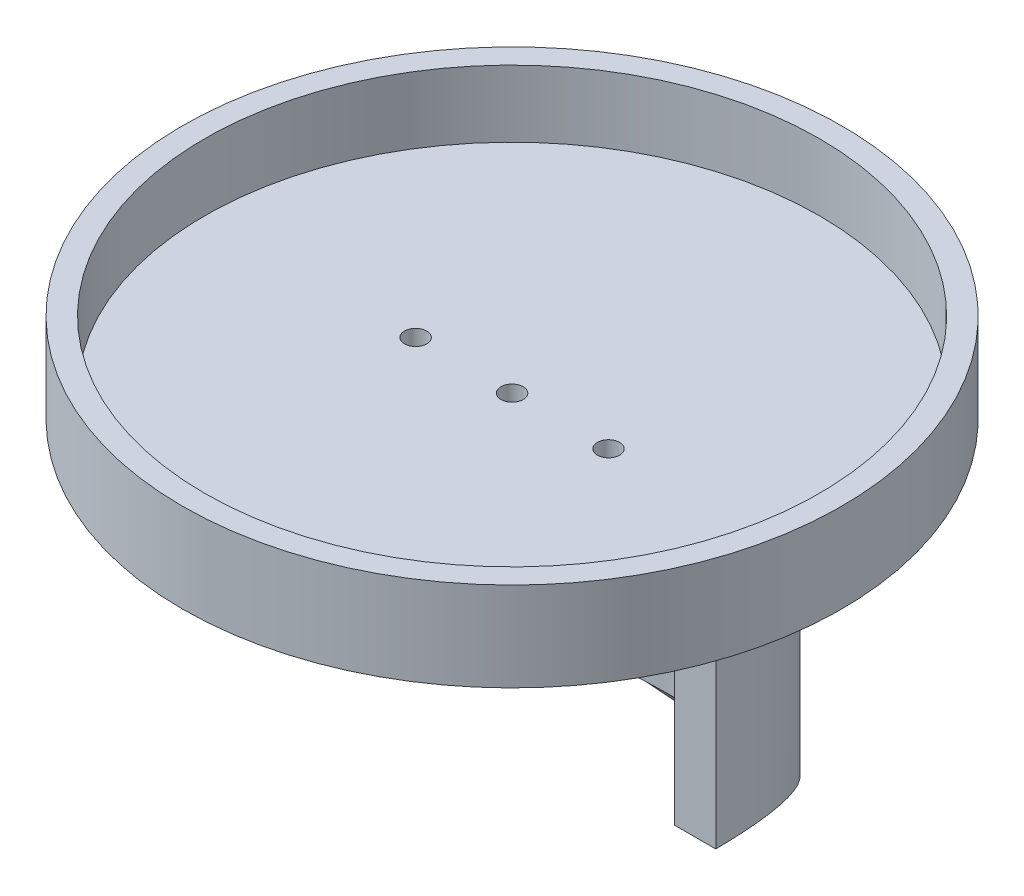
from build123d import *

# Parameters (mm, degrees)
SKETCH1_R                   = 74
BOSS_EXTRUDE1_DEPTH         = 20
BOSS_EXTRUDE2_DEPTH         = 70
BOSS_EXTRUDE3_DEPTH         = 70
TAP_DRILL_FOR_M6X1_0_TAP1_D = 5
CUT_EXTRUDE7_DEPTH          = 210.040803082
CUT_EXTRUDE7_DEPTH_BACK     = 210.040803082
SKETCH14_RX                 = 50.651437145
SKETCH14_RY                 = 39.339662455
SKETCH14_W                  = 59.614105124
SKETCH14_H                  = 39.742736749
SKETCH15_R                  = 71.5
CUT_EXTRUDE8_DEPTH          = 15
BOSS_EXTRUDE6_START         = 15
SKETCH16_R                  = 71.5
SKETCH16_R_2                = 69
BOSS_EXTRUDE6_DEPTH         = 15
SKETCH18_R                  = 74
SKETCH18_R_2                = 69
BOSS_EXTRUDE7_DEPTH         = 10


with BuildPart() as part:
    # Sketch1 → Boss-Extrude1 (new body)
    with BuildSketch(Plane(origin=(0, 0, 0), x_dir=(1, 0, 0), z_dir=(0, 1, 0))):
        with Locations(Location((-36.50845833, 35.022648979, 0), (0, 0, 270))):
            Circle(SKETCH1_R)
    extrude(amount=BOSS_EXTRUDE1_DEPTH)

    # Sketch3 → Boss-Extrude2 (add)
    with BuildSketch(Plane(origin=(0, 0, 0), x_dir=(-1, 0, 0), z_dir=(0, -1, 0))):
        with BuildLine():
            Line((-9.231094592, 35.022648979), (0, 35.022648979))
            ThreePointArc((0, 35.022648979), (36.50845833, 71.53110731), (73.01691666, 35.022648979))
            Line((73.01691666, 35.022648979), (82.248011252, 35.022648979))
            ThreePointArc((82.248011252, 35.022648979), (36.50845833, 80.762201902), (-9.231094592, 35.022648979))
        make_face()
    extrude(amount=BOSS_EXTRUDE2_DEPTH)

    # Sketch6 → Boss-Extrude3 (add)
    with BuildSketch(Plane.XZ.offset(70)):
        with BuildLine():
            Line((9.231094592, -35.022648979), (0, -35.022648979))
            ThreePointArc((0, -35.022648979), (-36.50845833, -71.53110731), (-73.01691666, -35.022648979))
            Line((-73.01691666, -35.022648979), (-82.248011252, -35.022648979))
            ThreePointArc((-82.248011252, -35.022648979), (-36.50845833, -80.762201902), (9.231094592, -35.022648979))
        make_face()
    extrude(amount=BOSS_EXTRUDE3_DEPTH)

    # Tap Drill for M6x1.0 Tap1 (through all)
    with Locations(Plane(origin=(0, 0, 0), x_dir=(-1, 0, 0), z_dir=(0, -1, 0))):
        with Locations((36.50845833, 35.022648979), (14.85845833, 35.022648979), (58.15845833, 35.022648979)):
            Hole(TAP_DRILL_FOR_M6X1_0_TAP1_D / 2)

    # Sketch14 → Cut-Extrude7 (cut, two sides: drawn at the far end of the back side and taken through both)
    with BuildSketch(Plane(origin=(0, 0, 0), x_dir=(0, 0, -1), z_dir=(1, 0, 0)).offset(-CUT_EXTRUDE7_DEPTH_BACK)):
        with Locations(Location((35.022648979, -100.124878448), (0, 0, -178.486878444))):
            Ellipse(SKETCH14_RX, SKETCH14_RY)
        with Locations((64.829701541, -133.753348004)):
            Rectangle(SKETCH14_W, SKETCH14_H)
        with BuildLine():
            Line((35.022648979, -139.469983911), (35.022648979, -113.88197963))
            Line((35.022648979, -113.88197963), (82.227917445, -113.88197963))
            add(Edge.make_bspline(
                [(82.227917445, -113.88197963), (104.563270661, -68.996459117), (43.843677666, -61.288765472), (-16.87591533, -53.581071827), (-15.611126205, -101.462374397)],
                knots=[2.75042936, 2.75042936, 2.75042936, 4.516807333, 4.516807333, 6.283185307, 6.283185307, 6.283185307], degree=2, weights=[1, 0.634690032, 1, 0.634690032, 1]))
            add(Edge.make_bspline(
                [(-15.611126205, -101.462374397), (-14.593420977, -139.98978661), (35.022648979, -139.469983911)],
                knots=[0, 0, 0, 1.550283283, 1.550283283, 1.550283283], degree=2, weights=[1, 0.714321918, 1]))
        make_face()
        with BuildLine():
            Line((82.227917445, -113.88197963), (35.022648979, -113.88197963))
            Line((35.022648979, -113.88197963), (35.022648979, -139.469983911))
            add(Edge.make_bspline(
                [(35.022648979, -139.469983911), (69.675798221, -139.106940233), (82.227917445, -113.88197963)],
                knots=[1.550283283, 1.550283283, 1.550283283, 2.75042936, 2.75042936, 2.75042936], degree=2, weights=[1, 0.825294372, 1]))
        make_face()
        with BuildLine():
            Line((35.022648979, -139.469983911), (35.022648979, -113.88197963))
            Line((35.022648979, -113.88197963), (82.227917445, -113.88197963))
            add(Edge.make_bspline(
                [(82.227917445, -113.88197963), (104.563270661, -68.996459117), (43.843677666, -61.288765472), (-16.87591533, -53.581071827), (-15.611126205, -101.462374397)],
                knots=[2.75042936, 2.75042936, 2.75042936, 4.516807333, 4.516807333, 6.283185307, 6.283185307, 6.283185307], degree=2, weights=[1, 0.634690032, 1, 0.634690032, 1]))
            add(Edge.make_bspline(
                [(-15.611126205, -101.462374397), (-14.593420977, -139.98978661), (35.022648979, -139.469983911)],
                knots=[0, 0, 0, 1.550283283, 1.550283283, 1.550283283], degree=2, weights=[1, 0.714321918, 1]))
        make_face()
        with BuildLine():
            Line((82.227917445, -113.88197963), (35.022648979, -113.88197963))
            Line((35.022648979, -113.88197963), (35.022648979, -139.469983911))
            add(Edge.make_bspline(
                [(35.022648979, -139.469983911), (69.675798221, -139.106940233), (82.227917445, -113.88197963)],
                knots=[1.550283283, 1.550283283, 1.550283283, 2.75042936, 2.75042936, 2.75042936], degree=2, weights=[1, 0.825294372, 1]))
        make_face()
    extrude(amount=CUT_EXTRUDE7_DEPTH + CUT_EXTRUDE7_DEPTH_BACK, mode=Mode.SUBTRACT)

    # Sketch15 → Cut-Extrude8 (cut)
    with BuildSketch(Plane(origin=(0, 20, 0), x_dir=(1, 0, 0), z_dir=(0, 1, 0))):
        with Locations(Location((-36.50845833, 35.022648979, 0), (0, 0, 270))):
            Circle(SKETCH15_R)
    extrude(amount=-CUT_EXTRUDE8_DEPTH, mode=Mode.SUBTRACT)

    # Sketch16 → Boss-Extrude6 (add)
    with BuildSketch(Plane(origin=(0, 5, 0), x_dir=(1, 0, 0), z_dir=(0, 1, 0)).offset(BOSS_EXTRUDE6_START)):
        with Locations((-36.50845833, 35.022648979)):
            Circle(SKETCH16_R)
        with Locations(Location((-36.50845833, 35.022648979, 0), (0, 0, 270))):
            Circle(SKETCH16_R_2, mode=Mode.SUBTRACT)
    extrude(amount=-BOSS_EXTRUDE6_DEPTH)

    # Sketch18 → Boss-Extrude7 (add)
    with BuildSketch(Plane(origin=(0, 5, 0), x_dir=(1, 0, 0), z_dir=(0, 1, 0))):
        with Locations(Location((-36.50845833, 35.022648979, 0), (0, 0, 270))):
            Circle(SKETCH18_R)
        with Locations(Location((-36.50845833, 35.022648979, 0), (0, 0, 270))):
            Circle(SKETCH18_R_2, mode=Mode.SUBTRACT)
    extrude(amount=BOSS_EXTRUDE7_DEPTH)


solid = part.part
